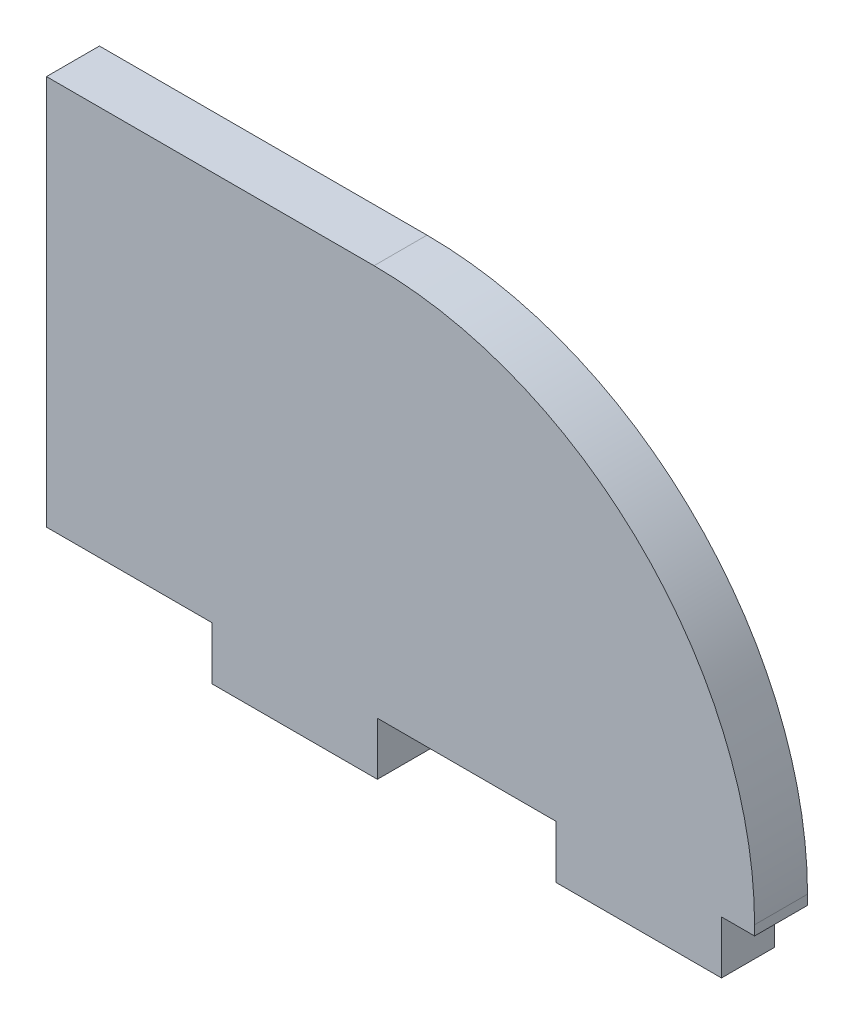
ISO-10303-21;
HEADER;
FILE_DESCRIPTION(('STEP AP214'),'2;1');
FILE_NAME('part.step','',(''),(''),'','','');
FILE_SCHEMA(('AUTOMOTIVE_DESIGN { 1 0 10303 214 1 1 1 1 }'));
ENDSEC;
DATA;
#1=APPLICATION_CONTEXT('core data for automotive mechanical design processes');
#2=APPLICATION_PROTOCOL_DEFINITION('international standard','automotive_design',2000,#1);
#3=PRODUCT_CONTEXT('',#1,'mechanical');
#4=PRODUCT('Part','Part','',(#3));
#5=PRODUCT_RELATED_PRODUCT_CATEGORY('part','',(#4));
#6=PRODUCT_DEFINITION_FORMATION('','',#4);
#7=PRODUCT_DEFINITION_CONTEXT('part definition',#1,'design');
#8=PRODUCT_DEFINITION('design','',#6,#7);
#9=PRODUCT_DEFINITION_SHAPE('','',#8);
#10=(LENGTH_UNIT() NAMED_UNIT(*) SI_UNIT(.MILLI.,.METRE.));
#11=(NAMED_UNIT(*) PLANE_ANGLE_UNIT() SI_UNIT($,.RADIAN.));
#12=(NAMED_UNIT(*) SI_UNIT($,.STERADIAN.) SOLID_ANGLE_UNIT());
#13=UNCERTAINTY_MEASURE_WITH_UNIT(LENGTH_MEASURE(1.E-05),#10,'distance_accuracy_value','');
#14=(GEOMETRIC_REPRESENTATION_CONTEXT(3) GLOBAL_UNCERTAINTY_ASSIGNED_CONTEXT((#13)) GLOBAL_UNIT_ASSIGNED_CONTEXT((#10,
#11,#12)) REPRESENTATION_CONTEXT('',''));
#15=CARTESIAN_POINT('',(0.,0.,0.));
#16=DIRECTION('',(0.,0.,1.));
#17=DIRECTION('',(1.,0.,0.));
#18=AXIS2_PLACEMENT_3D('',#15,#16,#17);
#19=CARTESIAN_POINT('',(99.,18.9330024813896,16.));
#20=DIRECTION('',(0.,0.,-1.));
#21=DIRECTION('',(-1.,0.,0.));
#22=AXIS2_PLACEMENT_3D('',#19,#20,#21);
#23=CYLINDRICAL_SURFACE('',#22,115.);
#24=DIRECTION('',(0.,0.,-1.));
#25=VECTOR('',#24,1.);
#26=CARTESIAN_POINT('',(99.,133.93300248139,16.));
#27=LINE('',#26,#25);
#28=CARTESIAN_POINT('',(99.,133.93300248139,16.));
#29=VERTEX_POINT('',#28);
#30=CARTESIAN_POINT('',(99.,133.93300248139,0.));
#31=VERTEX_POINT('',#30);
#32=EDGE_CURVE('E139',#29,#31,#27,.T.);
#33=ORIENTED_EDGE('',*,*,#32,.F.);
#34=CARTESIAN_POINT('',(99.,18.9330024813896,16.));
#35=DIRECTION('',(0.,0.,1.));
#36=DIRECTION('',(1.,0.,0.));
#37=AXIS2_PLACEMENT_3D('',#34,#35,#36);
#38=CIRCLE('',#37,115.);
#39=CARTESIAN_POINT('',(214.,18.9330024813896,16.));
#40=VERTEX_POINT('',#39);
#41=EDGE_CURVE('E46',#40,#29,#38,.T.);
#42=ORIENTED_EDGE('',*,*,#41,.F.);
#43=DIRECTION('',(0.,0.,-1.));
#44=VECTOR('',#43,1.);
#45=CARTESIAN_POINT('',(214.,18.9330024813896,16.));
#46=LINE('',#45,#44);
#47=CARTESIAN_POINT('',(214.,18.9330024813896,0.));
#48=VERTEX_POINT('',#47);
#49=EDGE_CURVE('E232',#48,#40,#46,.F.);
#50=ORIENTED_EDGE('',*,*,#49,.F.);
#51=CARTESIAN_POINT('',(99.,18.9330024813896,0.));
#52=DIRECTION('',(0.,0.,1.));
#53=DIRECTION('',(1.,0.,0.));
#54=AXIS2_PLACEMENT_3D('',#51,#52,#53);
#55=CIRCLE('',#54,115.);
#56=EDGE_CURVE('E11',#31,#48,#55,.F.);
#57=ORIENTED_EDGE('',*,*,#56,.F.);
#58=EDGE_LOOP('',(#33,#42,#50,#57));
#59=FACE_BOUND('',#58,.T.);
#60=ADVANCED_FACE('F39',(#59),#23,.T.);
#61=CARTESIAN_POINT('',(154.,0.,16.));
#62=DIRECTION('',(-1.,0.,0.));
#63=DIRECTION('',(0.,0.,1.));
#64=AXIS2_PLACEMENT_3D('',#61,#62,#63);
#65=PLANE('',#64);
#66=DIRECTION('',(0.,1.,0.));
#67=VECTOR('',#66,1.);
#68=CARTESIAN_POINT('',(154.,0.,0.));
#69=LINE('',#68,#67);
#70=CARTESIAN_POINT('',(154.,0.,0.));
#71=VERTEX_POINT('',#70);
#72=CARTESIAN_POINT('',(154.,16.,0.));
#73=VERTEX_POINT('',#72);
#74=EDGE_CURVE('E136',#71,#73,#69,.T.);
#75=ORIENTED_EDGE('',*,*,#74,.F.);
#76=DIRECTION('',(0.,0.,-1.));
#77=VECTOR('',#76,1.);
#78=CARTESIAN_POINT('',(154.,0.,16.));
#79=LINE('',#78,#77);
#80=CARTESIAN_POINT('',(154.,0.,16.));
#81=VERTEX_POINT('',#80);
#82=EDGE_CURVE('E130',#81,#71,#79,.T.);
#83=ORIENTED_EDGE('',*,*,#82,.F.);
#84=DIRECTION('',(0.,1.,0.));
#85=VECTOR('',#84,1.);
#86=CARTESIAN_POINT('',(154.,0.,16.));
#87=LINE('',#86,#85);
#88=CARTESIAN_POINT('',(154.,16.,16.));
#89=VERTEX_POINT('',#88);
#90=EDGE_CURVE('E134',#81,#89,#87,.T.);
#91=ORIENTED_EDGE('',*,*,#90,.T.);
#92=DIRECTION('',(0.,0.,-1.));
#93=VECTOR('',#92,1.);
#94=CARTESIAN_POINT('',(154.,16.,16.));
#95=LINE('',#94,#93);
#96=EDGE_CURVE('E183',#89,#73,#95,.T.);
#97=ORIENTED_EDGE('',*,*,#96,.T.);
#98=EDGE_LOOP('',(#75,#83,#91,#97));
#99=FACE_BOUND('',#98,.T.);
#100=ADVANCED_FACE('F132',(#99),#65,.T.);
#101=CARTESIAN_POINT('',(0.,0.,16.));
#102=DIRECTION('',(0.,1.,0.));
#103=DIRECTION('',(-1.,0.,0.));
#104=AXIS2_PLACEMENT_3D('',#101,#102,#103);
#105=PLANE('',#104);
#106=DIRECTION('',(1.,0.,0.));
#107=VECTOR('',#106,1.);
#108=CARTESIAN_POINT('',(0.,0.,0.));
#109=LINE('',#108,#107);
#110=CARTESIAN_POINT('',(204.,0.,0.));
#111=VERTEX_POINT('',#110);
#112=EDGE_CURVE('E185',#71,#111,#109,.T.);
#113=ORIENTED_EDGE('',*,*,#112,.T.);
#114=DIRECTION('',(0.,0.,-1.));
#115=VECTOR('',#114,1.);
#116=CARTESIAN_POINT('',(204.,0.,16.));
#117=LINE('',#116,#115);
#118=CARTESIAN_POINT('',(204.,0.,16.));
#119=VERTEX_POINT('',#118);
#120=EDGE_CURVE('E140',#119,#111,#117,.T.);
#121=ORIENTED_EDGE('',*,*,#120,.F.);
#122=DIRECTION('',(1.,0.,0.));
#123=VECTOR('',#122,1.);
#124=CARTESIAN_POINT('',(0.,0.,16.));
#125=LINE('',#124,#123);
#126=EDGE_CURVE('E143',#81,#119,#125,.T.);
#127=ORIENTED_EDGE('',*,*,#126,.F.);
#128=ORIENTED_EDGE('',*,*,#82,.T.);
#129=EDGE_LOOP('',(#113,#121,#127,#128));
#130=FACE_BOUND('',#129,.T.);
#131=ADVANCED_FACE('F144',(#130),#105,.F.);
#132=CARTESIAN_POINT('',(204.,0.,16.));
#133=DIRECTION('',(-1.,0.,0.));
#134=DIRECTION('',(0.,0.,1.));
#135=AXIS2_PLACEMENT_3D('',#132,#133,#134);
#136=PLANE('',#135);
#137=DIRECTION('',(0.,1.,0.));
#138=VECTOR('',#137,1.);
#139=CARTESIAN_POINT('',(204.,0.,0.));
#140=LINE('',#139,#138);
#141=CARTESIAN_POINT('',(204.,16.,0.));
#142=VERTEX_POINT('',#141);
#143=EDGE_CURVE('E187',#111,#142,#140,.T.);
#144=ORIENTED_EDGE('',*,*,#143,.T.);
#145=DIRECTION('',(0.,0.,-1.));
#146=VECTOR('',#145,1.);
#147=CARTESIAN_POINT('',(204.,16.,16.));
#148=LINE('',#147,#146);
#149=CARTESIAN_POINT('',(204.,16.,16.));
#150=VERTEX_POINT('',#149);
#151=EDGE_CURVE('E227',#150,#142,#148,.T.);
#152=ORIENTED_EDGE('',*,*,#151,.F.);
#153=DIRECTION('',(0.,1.,0.));
#154=VECTOR('',#153,1.);
#155=CARTESIAN_POINT('',(204.,0.,16.));
#156=LINE('',#155,#154);
#157=EDGE_CURVE('E148',#119,#150,#156,.T.);
#158=ORIENTED_EDGE('',*,*,#157,.F.);
#159=ORIENTED_EDGE('',*,*,#120,.T.);
#160=EDGE_LOOP('',(#144,#152,#158,#159));
#161=FACE_BOUND('',#160,.T.);
#162=ADVANCED_FACE('F267',(#161),#136,.F.);
#163=CARTESIAN_POINT('',(0.,16.,16.));
#164=DIRECTION('',(0.,-1.,0.));
#165=DIRECTION('',(0.,0.,-1.));
#166=AXIS2_PLACEMENT_3D('',#163,#164,#165);
#167=PLANE('',#166);
#168=DIRECTION('',(-1.,0.,0.));
#169=VECTOR('',#168,1.);
#170=CARTESIAN_POINT('',(0.,16.,0.));
#171=LINE('',#170,#169);
#172=CARTESIAN_POINT('',(214.,16.,0.));
#173=VERTEX_POINT('',#172);
#174=EDGE_CURVE('E190',#173,#142,#171,.T.);
#175=ORIENTED_EDGE('',*,*,#174,.F.);
#176=DIRECTION('',(0.,0.,-1.));
#177=VECTOR('',#176,1.);
#178=CARTESIAN_POINT('',(214.,16.,16.));
#179=LINE('',#178,#177);
#180=CARTESIAN_POINT('',(214.,16.,16.));
#181=VERTEX_POINT('',#180);
#182=EDGE_CURVE('E224',#181,#173,#179,.T.);
#183=ORIENTED_EDGE('',*,*,#182,.F.);
#184=DIRECTION('',(-1.,0.,0.));
#185=VECTOR('',#184,1.);
#186=CARTESIAN_POINT('',(0.,16.,16.));
#187=LINE('',#186,#185);
#188=EDGE_CURVE('E162',#181,#150,#187,.T.);
#189=ORIENTED_EDGE('',*,*,#188,.T.);
#190=ORIENTED_EDGE('',*,*,#151,.T.);
#191=EDGE_LOOP('',(#175,#183,#189,#190));
#192=FACE_BOUND('',#191,.T.);
#193=ADVANCED_FACE('F272',(#192),#167,.T.);
#194=CARTESIAN_POINT('',(214.,0.,16.));
#195=DIRECTION('',(1.,0.,0.));
#196=DIRECTION('',(0.,0.,-1.));
#197=AXIS2_PLACEMENT_3D('',#194,#195,#196);
#198=PLANE('',#197);
#199=DIRECTION('',(0.,-1.,0.));
#200=VECTOR('',#199,1.);
#201=CARTESIAN_POINT('',(214.,0.,0.));
#202=LINE('',#201,#200);
#203=EDGE_CURVE('E193',#48,#173,#202,.T.);
#204=ORIENTED_EDGE('',*,*,#203,.F.);
#205=ORIENTED_EDGE('',*,*,#49,.T.);
#206=DIRECTION('',(0.,-1.,0.));
#207=VECTOR('',#206,1.);
#208=CARTESIAN_POINT('',(214.,0.,16.));
#209=LINE('',#208,#207);
#210=EDGE_CURVE('E165',#40,#181,#209,.T.);
#211=ORIENTED_EDGE('',*,*,#210,.T.);
#212=ORIENTED_EDGE('',*,*,#182,.T.);
#213=EDGE_LOOP('',(#204,#205,#211,#212));
#214=FACE_BOUND('',#213,.T.);
#215=ADVANCED_FACE('F275',(#214),#198,.T.);
#216=CARTESIAN_POINT('',(0.,133.93300248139,16.));
#217=DIRECTION('',(0.,1.,0.));
#218=DIRECTION('',(0.,0.,1.));
#219=AXIS2_PLACEMENT_3D('',#216,#217,#218);
#220=PLANE('',#219);
#221=DIRECTION('',(1.,0.,0.));
#222=VECTOR('',#221,1.);
#223=CARTESIAN_POINT('',(0.,133.93300248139,16.));
#224=LINE('',#223,#222);
#225=CARTESIAN_POINT('',(0.,133.93300248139,16.));
#226=VERTEX_POINT('',#225);
#227=EDGE_CURVE('E167',#226,#29,#224,.T.);
#228=ORIENTED_EDGE('',*,*,#227,.T.);
#229=ORIENTED_EDGE('',*,*,#32,.T.);
#230=DIRECTION('',(1.,0.,0.));
#231=VECTOR('',#230,1.);
#232=CARTESIAN_POINT('',(0.,133.93300248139,0.));
#233=LINE('',#232,#231);
#234=CARTESIAN_POINT('',(0.,133.93300248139,0.));
#235=VERTEX_POINT('',#234);
#236=EDGE_CURVE('E195',#235,#31,#233,.T.);
#237=ORIENTED_EDGE('',*,*,#236,.F.);
#238=DIRECTION('',(0.,0.,-1.));
#239=VECTOR('',#238,1.);
#240=CARTESIAN_POINT('',(0.,133.93300248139,16.));
#241=LINE('',#240,#239);
#242=EDGE_CURVE('E222',#226,#235,#241,.T.);
#243=ORIENTED_EDGE('',*,*,#242,.F.);
#244=EDGE_LOOP('',(#228,#229,#237,#243));
#245=FACE_BOUND('',#244,.T.);
#246=ADVANCED_FACE('F238',(#245),#220,.T.);
#247=CARTESIAN_POINT('',(0.,0.,16.));
#248=DIRECTION('',(-1.,0.,0.));
#249=DIRECTION('',(0.,0.,1.));
#250=AXIS2_PLACEMENT_3D('',#247,#248,#249);
#251=PLANE('',#250);
#252=DIRECTION('',(0.,1.,0.));
#253=VECTOR('',#252,1.);
#254=CARTESIAN_POINT('',(0.,0.,0.));
#255=LINE('',#254,#253);
#256=CARTESIAN_POINT('',(0.,16.,0.));
#257=VERTEX_POINT('',#256);
#258=EDGE_CURVE('E197',#257,#235,#255,.T.);
#259=ORIENTED_EDGE('',*,*,#258,.F.);
#260=DIRECTION('',(0.,0.,-1.));
#261=VECTOR('',#260,1.);
#262=CARTESIAN_POINT('',(0.,16.,16.));
#263=LINE('',#262,#261);
#264=CARTESIAN_POINT('',(0.,16.,16.));
#265=VERTEX_POINT('',#264);
#266=EDGE_CURVE('E220',#265,#257,#263,.T.);
#267=ORIENTED_EDGE('',*,*,#266,.F.);
#268=DIRECTION('',(0.,1.,0.));
#269=VECTOR('',#268,1.);
#270=CARTESIAN_POINT('',(0.,0.,16.));
#271=LINE('',#270,#269);
#272=EDGE_CURVE('E170',#265,#226,#271,.T.);
#273=ORIENTED_EDGE('',*,*,#272,.T.);
#274=ORIENTED_EDGE('',*,*,#242,.T.);
#275=EDGE_LOOP('',(#259,#267,#273,#274));
#276=FACE_BOUND('',#275,.T.);
#277=ADVANCED_FACE('F241',(#276),#251,.T.);
#278=CARTESIAN_POINT('',(0.,16.,16.));
#279=DIRECTION('',(0.,1.,0.));
#280=DIRECTION('',(-1.,0.,0.));
#281=AXIS2_PLACEMENT_3D('',#278,#279,#280);
#282=PLANE('',#281);
#283=DIRECTION('',(1.,0.,0.));
#284=VECTOR('',#283,1.);
#285=CARTESIAN_POINT('',(0.,16.,0.));
#286=LINE('',#285,#284);
#287=CARTESIAN_POINT('',(50.,16.,0.));
#288=VERTEX_POINT('',#287);
#289=EDGE_CURVE('E200',#257,#288,#286,.T.);
#290=ORIENTED_EDGE('',*,*,#289,.T.);
#291=DIRECTION('',(0.,0.,-1.));
#292=VECTOR('',#291,1.);
#293=CARTESIAN_POINT('',(50.,16.,16.));
#294=LINE('',#293,#292);
#295=CARTESIAN_POINT('',(50.,16.,16.));
#296=VERTEX_POINT('',#295);
#297=EDGE_CURVE('E218',#296,#288,#294,.T.);
#298=ORIENTED_EDGE('',*,*,#297,.F.);
#299=DIRECTION('',(1.,0.,0.));
#300=VECTOR('',#299,1.);
#301=CARTESIAN_POINT('',(0.,16.,16.));
#302=LINE('',#301,#300);
#303=EDGE_CURVE('E173',#265,#296,#302,.T.);
#304=ORIENTED_EDGE('',*,*,#303,.F.);
#305=ORIENTED_EDGE('',*,*,#266,.T.);
#306=EDGE_LOOP('',(#290,#298,#304,#305));
#307=FACE_BOUND('',#306,.T.);
#308=ADVANCED_FACE('F246',(#307),#282,.F.);
#309=CARTESIAN_POINT('',(50.,0.,16.));
#310=DIRECTION('',(-1.,0.,0.));
#311=DIRECTION('',(0.,0.,1.));
#312=AXIS2_PLACEMENT_3D('',#309,#310,#311);
#313=PLANE('',#312);
#314=DIRECTION('',(0.,1.,0.));
#315=VECTOR('',#314,1.);
#316=CARTESIAN_POINT('',(50.,0.,0.));
#317=LINE('',#316,#315);
#318=CARTESIAN_POINT('',(50.,0.,0.));
#319=VERTEX_POINT('',#318);
#320=EDGE_CURVE('E203',#319,#288,#317,.T.);
#321=ORIENTED_EDGE('',*,*,#320,.F.);
#322=DIRECTION('',(0.,0.,-1.));
#323=VECTOR('',#322,1.);
#324=CARTESIAN_POINT('',(50.,0.,16.));
#325=LINE('',#324,#323);
#326=CARTESIAN_POINT('',(50.,0.,16.));
#327=VERTEX_POINT('',#326);
#328=EDGE_CURVE('E216',#327,#319,#325,.T.);
#329=ORIENTED_EDGE('',*,*,#328,.F.);
#330=DIRECTION('',(0.,1.,0.));
#331=VECTOR('',#330,1.);
#332=CARTESIAN_POINT('',(50.,0.,16.));
#333=LINE('',#332,#331);
#334=EDGE_CURVE('E175',#327,#296,#333,.T.);
#335=ORIENTED_EDGE('',*,*,#334,.T.);
#336=ORIENTED_EDGE('',*,*,#297,.T.);
#337=EDGE_LOOP('',(#321,#329,#335,#336));
#338=FACE_BOUND('',#337,.T.);
#339=ADVANCED_FACE('F250',(#338),#313,.T.);
#340=CARTESIAN_POINT('',(0.,0.,16.));
#341=DIRECTION('',(0.,1.,0.));
#342=DIRECTION('',(-1.,0.,0.));
#343=AXIS2_PLACEMENT_3D('',#340,#341,#342);
#344=PLANE('',#343);
#345=DIRECTION('',(1.,0.,0.));
#346=VECTOR('',#345,1.);
#347=CARTESIAN_POINT('',(0.,0.,0.));
#348=LINE('',#347,#346);
#349=CARTESIAN_POINT('',(99.9999999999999,0.,0.));
#350=VERTEX_POINT('',#349);
#351=EDGE_CURVE('E206',#319,#350,#348,.T.);
#352=ORIENTED_EDGE('',*,*,#351,.T.);
#353=DIRECTION('',(0.,0.,-1.));
#354=VECTOR('',#353,1.);
#355=CARTESIAN_POINT('',(99.9999999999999,0.,16.));
#356=LINE('',#355,#354);
#357=CARTESIAN_POINT('',(99.9999999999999,0.,16.));
#358=VERTEX_POINT('',#357);
#359=EDGE_CURVE('E213',#358,#350,#356,.T.);
#360=ORIENTED_EDGE('',*,*,#359,.F.);
#361=DIRECTION('',(1.,0.,0.));
#362=VECTOR('',#361,1.);
#363=CARTESIAN_POINT('',(0.,0.,16.));
#364=LINE('',#363,#362);
#365=EDGE_CURVE('E178',#327,#358,#364,.T.);
#366=ORIENTED_EDGE('',*,*,#365,.F.);
#367=ORIENTED_EDGE('',*,*,#328,.T.);
#368=EDGE_LOOP('',(#352,#360,#366,#367));
#369=FACE_BOUND('',#368,.T.);
#370=ADVANCED_FACE('F255',(#369),#344,.F.);
#371=CARTESIAN_POINT('',(99.9999999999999,0.,16.));
#372=DIRECTION('',(-1.,0.,0.));
#373=DIRECTION('',(0.,0.,1.));
#374=AXIS2_PLACEMENT_3D('',#371,#372,#373);
#375=PLANE('',#374);
#376=DIRECTION('',(0.,1.,0.));
#377=VECTOR('',#376,1.);
#378=CARTESIAN_POINT('',(99.9999999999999,0.,0.));
#379=LINE('',#378,#377);
#380=CARTESIAN_POINT('',(99.9999999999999,16.,0.));
#381=VERTEX_POINT('',#380);
#382=EDGE_CURVE('E158',#350,#381,#379,.T.);
#383=ORIENTED_EDGE('',*,*,#382,.T.);
#384=DIRECTION('',(0.,0.,-1.));
#385=VECTOR('',#384,1.);
#386=CARTESIAN_POINT('',(99.9999999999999,16.,16.));
#387=LINE('',#386,#385);
#388=CARTESIAN_POINT('',(99.9999999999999,16.,16.));
#389=VERTEX_POINT('',#388);
#390=EDGE_CURVE('E210',#389,#381,#387,.T.);
#391=ORIENTED_EDGE('',*,*,#390,.F.);
#392=DIRECTION('',(0.,1.,0.));
#393=VECTOR('',#392,1.);
#394=CARTESIAN_POINT('',(99.9999999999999,0.,16.));
#395=LINE('',#394,#393);
#396=EDGE_CURVE('E180',#358,#389,#395,.T.);
#397=ORIENTED_EDGE('',*,*,#396,.F.);
#398=ORIENTED_EDGE('',*,*,#359,.T.);
#399=EDGE_LOOP('',(#383,#391,#397,#398));
#400=FACE_BOUND('',#399,.T.);
#401=ADVANCED_FACE('F259',(#400),#375,.F.);
#402=CARTESIAN_POINT('',(0.,16.,16.));
#403=DIRECTION('',(0.,1.,0.));
#404=DIRECTION('',(0.,0.,1.));
#405=AXIS2_PLACEMENT_3D('',#402,#403,#404);
#406=PLANE('',#405);
#407=DIRECTION('',(1.,0.,0.));
#408=VECTOR('',#407,1.);
#409=CARTESIAN_POINT('',(0.,16.,0.));
#410=LINE('',#409,#408);
#411=EDGE_CURVE('E155',#381,#73,#410,.T.);
#412=ORIENTED_EDGE('',*,*,#411,.T.);
#413=ORIENTED_EDGE('',*,*,#96,.F.);
#414=DIRECTION('',(1.,0.,0.));
#415=VECTOR('',#414,1.);
#416=CARTESIAN_POINT('',(0.,16.,16.));
#417=LINE('',#416,#415);
#418=EDGE_CURVE('E153',#389,#89,#417,.T.);
#419=ORIENTED_EDGE('',*,*,#418,.F.);
#420=ORIENTED_EDGE('',*,*,#390,.T.);
#421=EDGE_LOOP('',(#412,#413,#419,#420));
#422=FACE_BOUND('',#421,.T.);
#423=ADVANCED_FACE('F263',(#422),#406,.F.);
#424=CARTESIAN_POINT('',(0.,0.,16.));
#425=DIRECTION('',(0.,0.,1.));
#426=DIRECTION('',(1.,0.,0.));
#427=AXIS2_PLACEMENT_3D('',#424,#425,#426);
#428=PLANE('',#427);
#429=ORIENTED_EDGE('',*,*,#210,.F.);
#430=ORIENTED_EDGE('',*,*,#41,.T.);
#431=ORIENTED_EDGE('',*,*,#227,.F.);
#432=ORIENTED_EDGE('',*,*,#272,.F.);
#433=ORIENTED_EDGE('',*,*,#303,.T.);
#434=ORIENTED_EDGE('',*,*,#334,.F.);
#435=ORIENTED_EDGE('',*,*,#365,.T.);
#436=ORIENTED_EDGE('',*,*,#396,.T.);
#437=ORIENTED_EDGE('',*,*,#418,.T.);
#438=ORIENTED_EDGE('',*,*,#90,.F.);
#439=ORIENTED_EDGE('',*,*,#126,.T.);
#440=ORIENTED_EDGE('',*,*,#157,.T.);
#441=ORIENTED_EDGE('',*,*,#188,.F.);
#442=EDGE_LOOP('',(#429,#430,#431,#432,#433,#434,#435,#436,#437,#438,#439,#440,#441));
#443=FACE_BOUND('',#442,.T.);
#444=ADVANCED_FACE('F151',(#443),#428,.T.);
#445=CARTESIAN_POINT('',(0.,0.,0.));
#446=DIRECTION('',(0.,0.,1.));
#447=DIRECTION('',(1.,0.,0.));
#448=AXIS2_PLACEMENT_3D('',#445,#446,#447);
#449=PLANE('',#448);
#450=ORIENTED_EDGE('',*,*,#236,.T.);
#451=ORIENTED_EDGE('',*,*,#56,.T.);
#452=ORIENTED_EDGE('',*,*,#203,.T.);
#453=ORIENTED_EDGE('',*,*,#174,.T.);
#454=ORIENTED_EDGE('',*,*,#143,.F.);
#455=ORIENTED_EDGE('',*,*,#112,.F.);
#456=ORIENTED_EDGE('',*,*,#74,.T.);
#457=ORIENTED_EDGE('',*,*,#411,.F.);
#458=ORIENTED_EDGE('',*,*,#382,.F.);
#459=ORIENTED_EDGE('',*,*,#351,.F.);
#460=ORIENTED_EDGE('',*,*,#320,.T.);
#461=ORIENTED_EDGE('',*,*,#289,.F.);
#462=ORIENTED_EDGE('',*,*,#258,.T.);
#463=EDGE_LOOP('',(#450,#451,#452,#453,#454,#455,#456,#457,#458,#459,#460,#461,#462));
#464=FACE_BOUND('',#463,.T.);
#465=ADVANCED_FACE('F264',(#464),#449,.F.);
#466=CLOSED_SHELL('',(#60,#100,#131,#162,#193,#215,#246,#277,#308,#339,#370,#401,#423,#444,#465));
#467=MANIFOLD_SOLID_BREP('B2',#466);
#468=ADVANCED_BREP_SHAPE_REPRESENTATION('',(#18,#467),#14);
#469=SHAPE_DEFINITION_REPRESENTATION(#9,#468);
ENDSEC;
END-ISO-10303-21;
